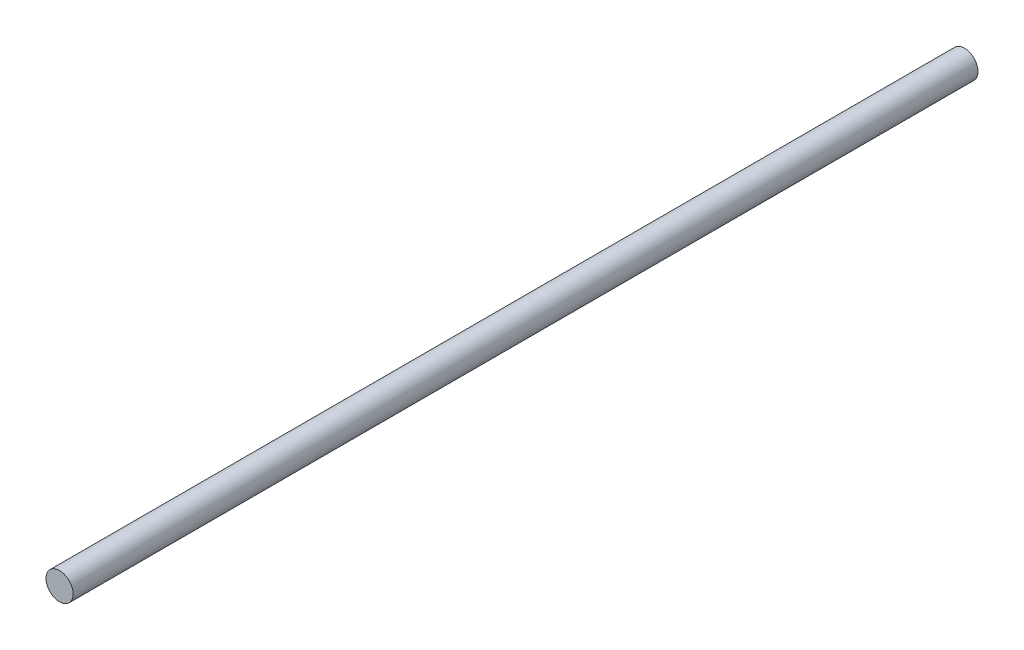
from build123d import *

# Parameters (mm, degrees)
SKETCH1_R           = 30
BOSS_EXTRUDE1_DEPTH = 2000


with BuildPart() as part:
    # Sketch1 → Boss-Extrude1 (new body)
    with BuildSketch(Plane.XY):
        Circle(SKETCH1_R)
    extrude(amount=-BOSS_EXTRUDE1_DEPTH)


solid = part.part
